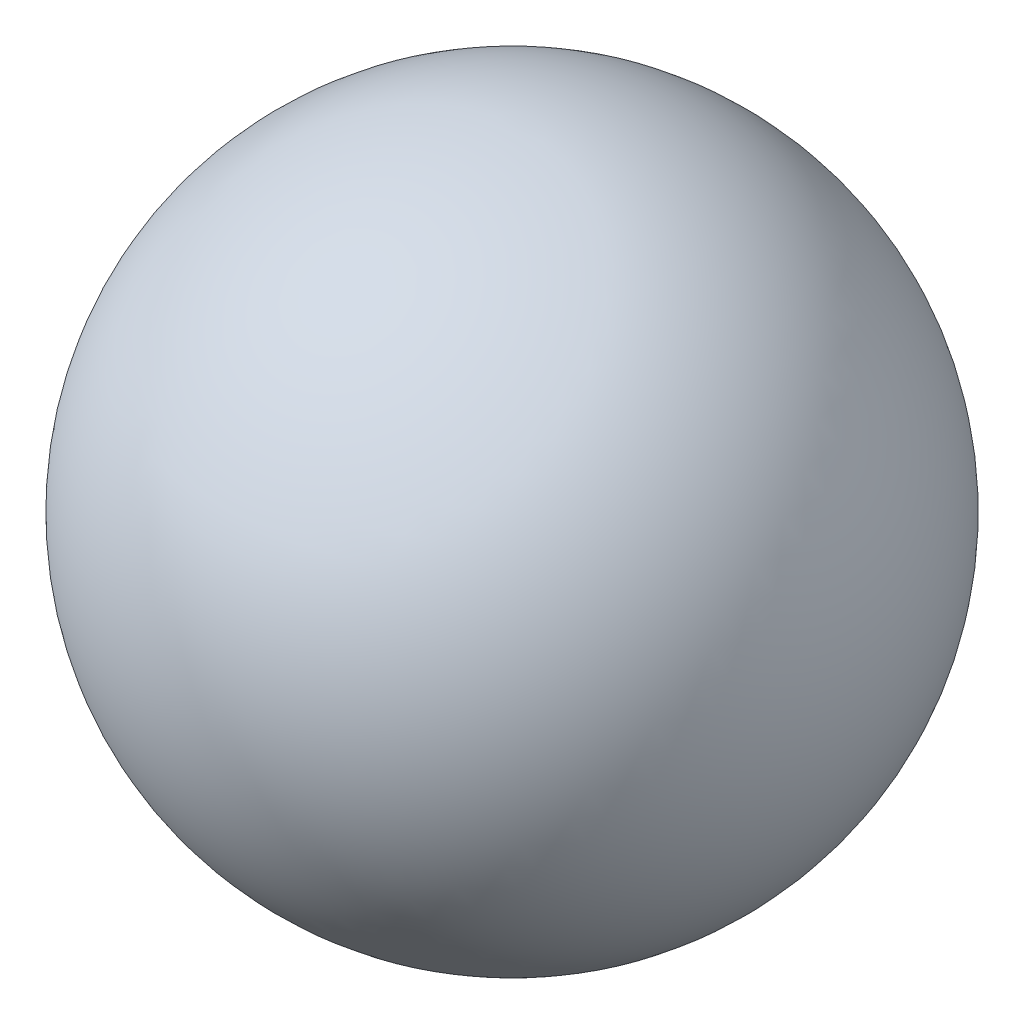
ISO-10303-21;
HEADER;
FILE_DESCRIPTION(('STEP AP214'),'2;1');
FILE_NAME('part.step','',(''),(''),'','','');
FILE_SCHEMA(('AUTOMOTIVE_DESIGN { 1 0 10303 214 1 1 1 1 }'));
ENDSEC;
DATA;
#1=APPLICATION_CONTEXT('core data for automotive mechanical design processes');
#2=APPLICATION_PROTOCOL_DEFINITION('international standard','automotive_design',2000,#1);
#3=PRODUCT_CONTEXT('',#1,'mechanical');
#4=PRODUCT('Part','Part','',(#3));
#5=PRODUCT_RELATED_PRODUCT_CATEGORY('part','',(#4));
#6=PRODUCT_DEFINITION_FORMATION('','',#4);
#7=PRODUCT_DEFINITION_CONTEXT('part definition',#1,'design');
#8=PRODUCT_DEFINITION('design','',#6,#7);
#9=PRODUCT_DEFINITION_SHAPE('','',#8);
#10=(LENGTH_UNIT() NAMED_UNIT(*) SI_UNIT(.MILLI.,.METRE.));
#11=(NAMED_UNIT(*) PLANE_ANGLE_UNIT() SI_UNIT($,.RADIAN.));
#12=(NAMED_UNIT(*) SI_UNIT($,.STERADIAN.) SOLID_ANGLE_UNIT());
#13=UNCERTAINTY_MEASURE_WITH_UNIT(LENGTH_MEASURE(1.E-05),#10,'distance_accuracy_value','');
#14=(GEOMETRIC_REPRESENTATION_CONTEXT(3) GLOBAL_UNCERTAINTY_ASSIGNED_CONTEXT((#13)) GLOBAL_UNIT_ASSIGNED_CONTEXT((#10,
#11,#12)) REPRESENTATION_CONTEXT('',''));
#15=CARTESIAN_POINT('',(0.,0.,0.));
#16=DIRECTION('',(0.,0.,1.));
#17=DIRECTION('',(1.,0.,0.));
#18=AXIS2_PLACEMENT_3D('',#15,#16,#17);
#19=CARTESIAN_POINT('',(0.,0.,0.));
#20=DIRECTION('',(0.,1.,0.));
#21=DIRECTION('',(1.,0.,0.));
#22=AXIS2_PLACEMENT_3D('',#19,#20,#21);
#23=SPHERICAL_SURFACE('',#22,0.35);
#24=CARTESIAN_POINT('',(0.,0.35,0.));
#25=VERTEX_POINT('',#24);
#26=VERTEX_LOOP('',#25);
#27=FACE_BOUND('',#26,.T.);
#28=ADVANCED_FACE('F31',(#27),#23,.T.);
#29=CLOSED_SHELL('',(#28));
#30=MANIFOLD_SOLID_BREP('B2',#29);
#31=ADVANCED_BREP_SHAPE_REPRESENTATION('',(#18,#30),#14);
#32=SHAPE_DEFINITION_REPRESENTATION(#9,#31);
ENDSEC;
END-ISO-10303-21;
